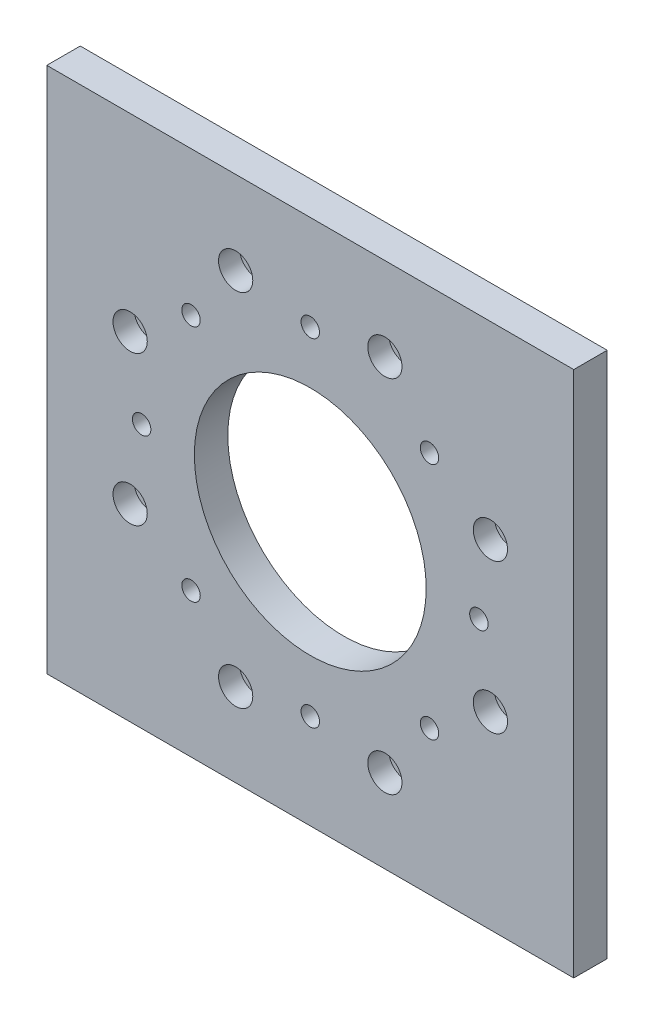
ISO-10303-21;
HEADER;
FILE_DESCRIPTION(('STEP AP214'),'2;1');
FILE_NAME('part.step','',(''),(''),'','','');
FILE_SCHEMA(('AUTOMOTIVE_DESIGN { 1 0 10303 214 1 1 1 1 }'));
ENDSEC;
DATA;
#1=APPLICATION_CONTEXT('core data for automotive mechanical design processes');
#2=APPLICATION_PROTOCOL_DEFINITION('international standard','automotive_design',2000,#1);
#3=PRODUCT_CONTEXT('',#1,'mechanical');
#4=PRODUCT('Part','Part','',(#3));
#5=PRODUCT_RELATED_PRODUCT_CATEGORY('part','',(#4));
#6=PRODUCT_DEFINITION_FORMATION('','',#4);
#7=PRODUCT_DEFINITION_CONTEXT('part definition',#1,'design');
#8=PRODUCT_DEFINITION('design','',#6,#7);
#9=PRODUCT_DEFINITION_SHAPE('','',#8);
#10=(LENGTH_UNIT() NAMED_UNIT(*) SI_UNIT(.MILLI.,.METRE.));
#11=(NAMED_UNIT(*) PLANE_ANGLE_UNIT() SI_UNIT($,.RADIAN.));
#12=(NAMED_UNIT(*) SI_UNIT($,.STERADIAN.) SOLID_ANGLE_UNIT());
#13=UNCERTAINTY_MEASURE_WITH_UNIT(LENGTH_MEASURE(1.E-05),#10,'distance_accuracy_value','');
#14=(GEOMETRIC_REPRESENTATION_CONTEXT(3) GLOBAL_UNCERTAINTY_ASSIGNED_CONTEXT((#13)) GLOBAL_UNIT_ASSIGNED_CONTEXT((#10,
#11,#12)) REPRESENTATION_CONTEXT('',''));
#15=CARTESIAN_POINT('',(0.,0.,0.));
#16=DIRECTION('',(0.,0.,1.));
#17=DIRECTION('',(1.,0.,0.));
#18=AXIS2_PLACEMENT_3D('',#15,#16,#17);
#19=CARTESIAN_POINT('',(34.1835427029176,14.1592869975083,0.));
#20=DIRECTION('',(0.,0.,1.));
#21=DIRECTION('',(1.,0.,0.));
#22=AXIS2_PLACEMENT_3D('',#19,#20,#21);
#23=CYLINDRICAL_SURFACE('',#22,1.5);
#24=CARTESIAN_POINT('',(34.1835427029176,14.1592869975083,0.));
#25=DIRECTION('',(0.,0.,1.));
#26=DIRECTION('',(1.,0.,0.));
#27=AXIS2_PLACEMENT_3D('',#24,#25,#26);
#28=CIRCLE('',#27,1.5);
#29=CARTESIAN_POINT('',(35.6835427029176,14.1592869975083,0.));
#30=VERTEX_POINT('',#29);
#31=EDGE_CURVE('E154',#30,#30,#28,.T.);
#32=ORIENTED_EDGE('',*,*,#31,.F.);
#33=EDGE_LOOP('',(#32));
#34=FACE_BOUND('',#33,.T.);
#35=CARTESIAN_POINT('',(34.1835427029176,14.1592869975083,2.35));
#36=DIRECTION('',(0.,0.,1.));
#37=DIRECTION('',(1.,0.,0.));
#38=AXIS2_PLACEMENT_3D('',#35,#36,#37);
#39=CIRCLE('',#38,1.5);
#40=CARTESIAN_POINT('',(35.6835427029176,14.1592869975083,2.35));
#41=VERTEX_POINT('',#40);
#42=EDGE_CURVE('E50',#41,#41,#39,.F.);
#43=ORIENTED_EDGE('',*,*,#42,.F.);
#44=EDGE_LOOP('',(#43));
#45=FACE_BOUND('',#44,.T.);
#46=ADVANCED_FACE('F43',(#34,#45),#23,.F.);
#47=CARTESIAN_POINT('',(34.1835427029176,-14.1592869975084,0.));
#48=DIRECTION('',(0.,0.,1.));
#49=DIRECTION('',(1.,0.,0.));
#50=AXIS2_PLACEMENT_3D('',#47,#48,#49);
#51=CYLINDRICAL_SURFACE('',#50,1.5);
#52=CARTESIAN_POINT('',(34.1835427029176,-14.1592869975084,0.));
#53=DIRECTION('',(0.,0.,1.));
#54=DIRECTION('',(1.,0.,0.));
#55=AXIS2_PLACEMENT_3D('',#52,#53,#54);
#56=CIRCLE('',#55,1.5);
#57=CARTESIAN_POINT('',(35.6835427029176,-14.1592869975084,0.));
#58=VERTEX_POINT('',#57);
#59=EDGE_CURVE('E157',#58,#58,#56,.T.);
#60=ORIENTED_EDGE('',*,*,#59,.F.);
#61=EDGE_LOOP('',(#60));
#62=FACE_BOUND('',#61,.T.);
#63=CARTESIAN_POINT('',(34.1835427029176,-14.1592869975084,2.35));
#64=DIRECTION('',(0.,0.,1.));
#65=DIRECTION('',(1.,0.,0.));
#66=AXIS2_PLACEMENT_3D('',#63,#64,#65);
#67=CIRCLE('',#66,1.5);
#68=CARTESIAN_POINT('',(35.6835427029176,-14.1592869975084,2.35));
#69=VERTEX_POINT('',#68);
#70=EDGE_CURVE('E140',#69,#69,#67,.F.);
#71=ORIENTED_EDGE('',*,*,#70,.F.);
#72=EDGE_LOOP('',(#71));
#73=FACE_BOUND('',#72,.T.);
#74=ADVANCED_FACE('F236',(#62,#73),#51,.F.);
#75=CARTESIAN_POINT('',(14.1592869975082,-34.1835427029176,0.));
#76=DIRECTION('',(0.,0.,1.));
#77=DIRECTION('',(1.,0.,0.));
#78=AXIS2_PLACEMENT_3D('',#75,#76,#77);
#79=CYLINDRICAL_SURFACE('',#78,1.5);
#80=CARTESIAN_POINT('',(14.1592869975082,-34.1835427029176,0.));
#81=DIRECTION('',(0.,0.,1.));
#82=DIRECTION('',(1.,0.,0.));
#83=AXIS2_PLACEMENT_3D('',#80,#81,#82);
#84=CIRCLE('',#83,1.5);
#85=CARTESIAN_POINT('',(15.6592869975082,-34.1835427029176,0.));
#86=VERTEX_POINT('',#85);
#87=EDGE_CURVE('E593',#86,#86,#84,.T.);
#88=ORIENTED_EDGE('',*,*,#87,.F.);
#89=EDGE_LOOP('',(#88));
#90=FACE_BOUND('',#89,.T.);
#91=CARTESIAN_POINT('',(14.1592869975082,-34.1835427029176,2.35));
#92=DIRECTION('',(0.,0.,1.));
#93=DIRECTION('',(1.,0.,0.));
#94=AXIS2_PLACEMENT_3D('',#91,#92,#93);
#95=CIRCLE('',#94,1.5);
#96=CARTESIAN_POINT('',(15.6592869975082,-34.1835427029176,2.35));
#97=VERTEX_POINT('',#96);
#98=EDGE_CURVE('E133',#97,#97,#95,.F.);
#99=ORIENTED_EDGE('',*,*,#98,.F.);
#100=EDGE_LOOP('',(#99));
#101=FACE_BOUND('',#100,.T.);
#102=ADVANCED_FACE('F241',(#90,#101),#79,.F.);
#103=CARTESIAN_POINT('',(-14.1592869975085,-34.1835427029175,0.));
#104=DIRECTION('',(0.,0.,1.));
#105=DIRECTION('',(1.,0.,0.));
#106=AXIS2_PLACEMENT_3D('',#103,#104,#105);
#107=CYLINDRICAL_SURFACE('',#106,1.5);
#108=CARTESIAN_POINT('',(-14.1592869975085,-34.1835427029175,0.));
#109=DIRECTION('',(0.,0.,1.));
#110=DIRECTION('',(1.,0.,0.));
#111=AXIS2_PLACEMENT_3D('',#108,#109,#110);
#112=CIRCLE('',#111,1.5);
#113=CARTESIAN_POINT('',(-12.6592869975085,-34.1835427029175,0.));
#114=VERTEX_POINT('',#113);
#115=EDGE_CURVE('E596',#114,#114,#112,.T.);
#116=ORIENTED_EDGE('',*,*,#115,.F.);
#117=EDGE_LOOP('',(#116));
#118=FACE_BOUND('',#117,.T.);
#119=CARTESIAN_POINT('',(-14.1592869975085,-34.1835427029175,2.35));
#120=DIRECTION('',(0.,0.,1.));
#121=DIRECTION('',(1.,0.,0.));
#122=AXIS2_PLACEMENT_3D('',#119,#120,#121);
#123=CIRCLE('',#122,1.5);
#124=CARTESIAN_POINT('',(-12.6592869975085,-34.1835427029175,2.35));
#125=VERTEX_POINT('',#124);
#126=EDGE_CURVE('E134',#125,#125,#123,.F.);
#127=ORIENTED_EDGE('',*,*,#126,.F.);
#128=EDGE_LOOP('',(#127));
#129=FACE_BOUND('',#128,.T.);
#130=ADVANCED_FACE('F384',(#118,#129),#107,.F.);
#131=CARTESIAN_POINT('',(-34.1835427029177,-14.1592869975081,0.));
#132=DIRECTION('',(0.,0.,1.));
#133=DIRECTION('',(1.,0.,0.));
#134=AXIS2_PLACEMENT_3D('',#131,#132,#133);
#135=CYLINDRICAL_SURFACE('',#134,1.50000000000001);
#136=CARTESIAN_POINT('',(-34.1835427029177,-14.1592869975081,0.));
#137=DIRECTION('',(0.,0.,1.));
#138=DIRECTION('',(1.,0.,0.));
#139=AXIS2_PLACEMENT_3D('',#136,#137,#138);
#140=CIRCLE('',#139,1.50000000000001);
#141=CARTESIAN_POINT('',(-32.6835427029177,-14.1592869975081,0.));
#142=VERTEX_POINT('',#141);
#143=EDGE_CURVE('E597',#142,#142,#140,.T.);
#144=ORIENTED_EDGE('',*,*,#143,.F.);
#145=EDGE_LOOP('',(#144));
#146=FACE_BOUND('',#145,.T.);
#147=CARTESIAN_POINT('',(-34.1835427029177,-14.1592869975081,2.35));
#148=DIRECTION('',(0.,0.,1.));
#149=DIRECTION('',(1.,0.,0.));
#150=AXIS2_PLACEMENT_3D('',#147,#148,#149);
#151=CIRCLE('',#150,1.50000000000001);
#152=CARTESIAN_POINT('',(-32.6835427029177,-14.1592869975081,2.35));
#153=VERTEX_POINT('',#152);
#154=EDGE_CURVE('E129',#153,#153,#151,.F.);
#155=ORIENTED_EDGE('',*,*,#154,.F.);
#156=EDGE_LOOP('',(#155));
#157=FACE_BOUND('',#156,.T.);
#158=ADVANCED_FACE('F374',(#146,#157),#135,.F.);
#159=CARTESIAN_POINT('',(-34.1835427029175,14.1592869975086,0.));
#160=DIRECTION('',(0.,0.,1.));
#161=DIRECTION('',(1.,0.,0.));
#162=AXIS2_PLACEMENT_3D('',#159,#160,#161);
#163=CYLINDRICAL_SURFACE('',#162,1.5);
#164=CARTESIAN_POINT('',(-34.1835427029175,14.1592869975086,0.));
#165=DIRECTION('',(0.,0.,1.));
#166=DIRECTION('',(1.,0.,0.));
#167=AXIS2_PLACEMENT_3D('',#164,#165,#166);
#168=CIRCLE('',#167,1.5);
#169=CARTESIAN_POINT('',(-32.6835427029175,14.1592869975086,0.));
#170=VERTEX_POINT('',#169);
#171=EDGE_CURVE('E151',#170,#170,#168,.T.);
#172=ORIENTED_EDGE('',*,*,#171,.F.);
#173=EDGE_LOOP('',(#172));
#174=FACE_BOUND('',#173,.T.);
#175=CARTESIAN_POINT('',(-34.1835427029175,14.1592869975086,2.35));
#176=DIRECTION('',(0.,0.,1.));
#177=DIRECTION('',(1.,0.,0.));
#178=AXIS2_PLACEMENT_3D('',#175,#176,#177);
#179=CIRCLE('',#178,1.5);
#180=CARTESIAN_POINT('',(-32.6835427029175,14.1592869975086,2.35));
#181=VERTEX_POINT('',#180);
#182=EDGE_CURVE('E127',#181,#181,#179,.F.);
#183=ORIENTED_EDGE('',*,*,#182,.F.);
#184=EDGE_LOOP('',(#183));
#185=FACE_BOUND('',#184,.T.);
#186=ADVANCED_FACE('F368',(#174,#185),#163,.F.);
#187=CARTESIAN_POINT('',(-14.159286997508,34.1835427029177,0.));
#188=DIRECTION('',(0.,0.,1.));
#189=DIRECTION('',(1.,0.,0.));
#190=AXIS2_PLACEMENT_3D('',#187,#188,#189);
#191=CYLINDRICAL_SURFACE('',#190,1.50000000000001);
#192=CARTESIAN_POINT('',(-14.159286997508,34.1835427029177,0.));
#193=DIRECTION('',(0.,0.,1.));
#194=DIRECTION('',(1.,0.,0.));
#195=AXIS2_PLACEMENT_3D('',#192,#193,#194);
#196=CIRCLE('',#195,1.50000000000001);
#197=CARTESIAN_POINT('',(-12.659286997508,34.1835427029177,0.));
#198=VERTEX_POINT('',#197);
#199=EDGE_CURVE('E148',#198,#198,#196,.T.);
#200=ORIENTED_EDGE('',*,*,#199,.F.);
#201=EDGE_LOOP('',(#200));
#202=FACE_BOUND('',#201,.T.);
#203=CARTESIAN_POINT('',(-14.159286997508,34.1835427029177,2.35));
#204=DIRECTION('',(0.,0.,1.));
#205=DIRECTION('',(1.,0.,0.));
#206=AXIS2_PLACEMENT_3D('',#203,#204,#205);
#207=CIRCLE('',#206,1.50000000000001);
#208=CARTESIAN_POINT('',(-12.659286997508,34.1835427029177,2.35));
#209=VERTEX_POINT('',#208);
#210=EDGE_CURVE('E125',#209,#209,#207,.F.);
#211=ORIENTED_EDGE('',*,*,#210,.F.);
#212=EDGE_LOOP('',(#211));
#213=FACE_BOUND('',#212,.T.);
#214=ADVANCED_FACE('F360',(#202,#213),#191,.F.);
#215=CARTESIAN_POINT('',(14.1592869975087,34.1835427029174,0.));
#216=DIRECTION('',(0.,0.,1.));
#217=DIRECTION('',(1.,0.,0.));
#218=AXIS2_PLACEMENT_3D('',#215,#216,#217);
#219=CYLINDRICAL_SURFACE('',#218,1.5);
#220=CARTESIAN_POINT('',(14.1592869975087,34.1835427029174,0.));
#221=DIRECTION('',(0.,0.,1.));
#222=DIRECTION('',(1.,0.,0.));
#223=AXIS2_PLACEMENT_3D('',#220,#221,#222);
#224=CIRCLE('',#223,1.5);
#225=CARTESIAN_POINT('',(15.6592869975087,34.1835427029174,0.));
#226=VERTEX_POINT('',#225);
#227=EDGE_CURVE('E142',#226,#226,#224,.T.);
#228=ORIENTED_EDGE('',*,*,#227,.F.);
#229=EDGE_LOOP('',(#228));
#230=FACE_BOUND('',#229,.T.);
#231=CARTESIAN_POINT('',(14.1592869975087,34.1835427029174,2.35));
#232=DIRECTION('',(0.,0.,1.));
#233=DIRECTION('',(1.,0.,0.));
#234=AXIS2_PLACEMENT_3D('',#231,#232,#233);
#235=CIRCLE('',#234,1.5);
#236=CARTESIAN_POINT('',(15.6592869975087,34.1835427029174,2.35));
#237=VERTEX_POINT('',#236);
#238=EDGE_CURVE('E116',#237,#237,#235,.F.);
#239=ORIENTED_EDGE('',*,*,#238,.F.);
#240=EDGE_LOOP('',(#239));
#241=FACE_BOUND('',#240,.T.);
#242=ADVANCED_FACE('F253',(#230,#241),#219,.F.);
#243=CARTESIAN_POINT('',(-49.9999999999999,50.,6.35));
#244=DIRECTION('',(0.,-1.,0.));
#245=DIRECTION('',(0.,0.,-1.));
#246=AXIS2_PLACEMENT_3D('',#243,#244,#245);
#247=PLANE('',#246);
#248=DIRECTION('',(-1.,0.,0.));
#249=VECTOR('',#248,1.);
#250=CARTESIAN_POINT('',(-49.9999999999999,50.,0.));
#251=LINE('',#250,#249);
#252=CARTESIAN_POINT('',(50.0000000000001,50.,0.));
#253=VERTEX_POINT('',#252);
#254=CARTESIAN_POINT('',(-49.9999999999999,50.,0.));
#255=VERTEX_POINT('',#254);
#256=EDGE_CURVE('E109',#253,#255,#251,.T.);
#257=ORIENTED_EDGE('',*,*,#256,.T.);
#258=DIRECTION('',(0.,0.,-1.));
#259=VECTOR('',#258,1.);
#260=CARTESIAN_POINT('',(-49.9999999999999,50.,6.35));
#261=LINE('',#260,#259);
#262=CARTESIAN_POINT('',(-49.9999999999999,50.,6.35));
#263=VERTEX_POINT('',#262);
#264=EDGE_CURVE('E11',#263,#255,#261,.T.);
#265=ORIENTED_EDGE('',*,*,#264,.F.);
#266=DIRECTION('',(-1.,0.,0.));
#267=VECTOR('',#266,1.);
#268=CARTESIAN_POINT('',(-49.9999999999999,50.,6.35));
#269=LINE('',#268,#267);
#270=CARTESIAN_POINT('',(50.0000000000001,50.,6.35));
#271=VERTEX_POINT('',#270);
#272=EDGE_CURVE('E100',#271,#263,#269,.T.);
#273=ORIENTED_EDGE('',*,*,#272,.F.);
#274=DIRECTION('',(0.,0.,-1.));
#275=VECTOR('',#274,1.);
#276=CARTESIAN_POINT('',(50.0000000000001,50.,6.35));
#277=LINE('',#276,#275);
#278=EDGE_CURVE('E106',#271,#253,#277,.T.);
#279=ORIENTED_EDGE('',*,*,#278,.T.);
#280=EDGE_LOOP('',(#257,#265,#273,#279));
#281=FACE_BOUND('',#280,.T.);
#282=ADVANCED_FACE('F44',(#281),#247,.F.);
#283=CARTESIAN_POINT('',(-49.9999999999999,-50.,6.35));
#284=DIRECTION('',(1.,0.,0.));
#285=DIRECTION('',(0.,0.,-1.));
#286=AXIS2_PLACEMENT_3D('',#283,#284,#285);
#287=PLANE('',#286);
#288=DIRECTION('',(0.,-1.,0.));
#289=VECTOR('',#288,1.);
#290=CARTESIAN_POINT('',(-49.9999999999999,-50.,0.));
#291=LINE('',#290,#289);
#292=CARTESIAN_POINT('',(-49.9999999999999,-50.,0.));
#293=VERTEX_POINT('',#292);
#294=EDGE_CURVE('E101',#255,#293,#291,.T.);
#295=ORIENTED_EDGE('',*,*,#294,.T.);
#296=DIRECTION('',(0.,0.,-1.));
#297=VECTOR('',#296,1.);
#298=CARTESIAN_POINT('',(-49.9999999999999,-50.,6.35));
#299=LINE('',#298,#297);
#300=CARTESIAN_POINT('',(-49.9999999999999,-50.,6.35));
#301=VERTEX_POINT('',#300);
#302=EDGE_CURVE('E52',#301,#293,#299,.T.);
#303=ORIENTED_EDGE('',*,*,#302,.F.);
#304=DIRECTION('',(0.,-1.,0.));
#305=VECTOR('',#304,1.);
#306=CARTESIAN_POINT('',(-49.9999999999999,-50.,6.35));
#307=LINE('',#306,#305);
#308=EDGE_CURVE('E95',#263,#301,#307,.T.);
#309=ORIENTED_EDGE('',*,*,#308,.F.);
#310=ORIENTED_EDGE('',*,*,#264,.T.);
#311=EDGE_LOOP('',(#295,#303,#309,#310));
#312=FACE_BOUND('',#311,.T.);
#313=ADVANCED_FACE('F99',(#312),#287,.F.);
#314=CARTESIAN_POINT('',(-49.9999999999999,-50.,6.35));
#315=DIRECTION('',(0.,1.,0.));
#316=DIRECTION('',(-1.,0.,0.));
#317=AXIS2_PLACEMENT_3D('',#314,#315,#316);
#318=PLANE('',#317);
#319=DIRECTION('',(1.,0.,0.));
#320=VECTOR('',#319,1.);
#321=CARTESIAN_POINT('',(-49.9999999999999,-50.,0.));
#322=LINE('',#321,#320);
#323=CARTESIAN_POINT('',(50.0000000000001,-49.9999999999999,0.));
#324=VERTEX_POINT('',#323);
#325=EDGE_CURVE('E76',#293,#324,#322,.T.);
#326=ORIENTED_EDGE('',*,*,#325,.T.);
#327=DIRECTION('',(0.,0.,-1.));
#328=VECTOR('',#327,1.);
#329=CARTESIAN_POINT('',(50.0000000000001,-49.9999999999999,6.35));
#330=LINE('',#329,#328);
#331=CARTESIAN_POINT('',(50.0000000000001,-49.9999999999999,6.35));
#332=VERTEX_POINT('',#331);
#333=EDGE_CURVE('E105',#332,#324,#330,.T.);
#334=ORIENTED_EDGE('',*,*,#333,.F.);
#335=DIRECTION('',(1.,0.,0.));
#336=VECTOR('',#335,1.);
#337=CARTESIAN_POINT('',(-49.9999999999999,-50.,6.35));
#338=LINE('',#337,#336);
#339=EDGE_CURVE('E92',#301,#332,#338,.T.);
#340=ORIENTED_EDGE('',*,*,#339,.F.);
#341=ORIENTED_EDGE('',*,*,#302,.T.);
#342=EDGE_LOOP('',(#326,#334,#340,#341));
#343=FACE_BOUND('',#342,.T.);
#344=ADVANCED_FACE('F102',(#343),#318,.F.);
#345=CARTESIAN_POINT('',(50.0000000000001,-49.9999999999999,6.35));
#346=DIRECTION('',(-1.,0.,0.));
#347=DIRECTION('',(0.,0.,1.));
#348=AXIS2_PLACEMENT_3D('',#345,#346,#347);
#349=PLANE('',#348);
#350=DIRECTION('',(0.,1.,0.));
#351=VECTOR('',#350,1.);
#352=CARTESIAN_POINT('',(50.0000000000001,-49.9999999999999,0.));
#353=LINE('',#352,#351);
#354=EDGE_CURVE('E84',#324,#253,#353,.T.);
#355=ORIENTED_EDGE('',*,*,#354,.T.);
#356=ORIENTED_EDGE('',*,*,#278,.F.);
#357=DIRECTION('',(0.,1.,0.));
#358=VECTOR('',#357,1.);
#359=CARTESIAN_POINT('',(50.0000000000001,-49.9999999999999,6.35));
#360=LINE('',#359,#358);
#361=EDGE_CURVE('E64',#332,#271,#360,.T.);
#362=ORIENTED_EDGE('',*,*,#361,.F.);
#363=ORIENTED_EDGE('',*,*,#333,.T.);
#364=EDGE_LOOP('',(#355,#356,#362,#363));
#365=FACE_BOUND('',#364,.T.);
#366=ADVANCED_FACE('F221',(#365),#349,.F.);
#367=CARTESIAN_POINT('',(0.,0.,6.35));
#368=DIRECTION('',(0.,0.,1.));
#369=DIRECTION('',(1.,0.,0.));
#370=AXIS2_PLACEMENT_3D('',#367,#368,#369);
#371=PLANE('',#370);
#372=CARTESIAN_POINT('',(14.1592869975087,34.1835427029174,6.35));
#373=DIRECTION('',(0.,0.,1.));
#374=DIRECTION('',(1.,0.,0.));
#375=AXIS2_PLACEMENT_3D('',#372,#373,#374);
#376=CIRCLE('',#375,3.25000000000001);
#377=CARTESIAN_POINT('',(17.4092869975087,34.1835427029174,6.35));
#378=VERTEX_POINT('',#377);
#379=EDGE_CURVE('E661',#378,#378,#376,.T.);
#380=ORIENTED_EDGE('',*,*,#379,.F.);
#381=EDGE_LOOP('',(#380));
#382=FACE_BOUND('',#381,.T.);
#383=CARTESIAN_POINT('',(-14.159286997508,34.1835427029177,6.35));
#384=DIRECTION('',(0.,0.,1.));
#385=DIRECTION('',(1.,0.,0.));
#386=AXIS2_PLACEMENT_3D('',#383,#384,#385);
#387=CIRCLE('',#386,3.25);
#388=CARTESIAN_POINT('',(-10.909286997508,34.1835427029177,6.35));
#389=VERTEX_POINT('',#388);
#390=EDGE_CURVE('E668',#389,#389,#387,.T.);
#391=ORIENTED_EDGE('',*,*,#390,.F.);
#392=EDGE_LOOP('',(#391));
#393=FACE_BOUND('',#392,.T.);
#394=CARTESIAN_POINT('',(-34.1835427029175,14.1592869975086,6.35));
#395=DIRECTION('',(0.,0.,1.));
#396=DIRECTION('',(1.,0.,0.));
#397=AXIS2_PLACEMENT_3D('',#394,#395,#396);
#398=CIRCLE('',#397,3.25);
#399=CARTESIAN_POINT('',(-30.9335427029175,14.1592869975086,6.35));
#400=VERTEX_POINT('',#399);
#401=EDGE_CURVE('E677',#400,#400,#398,.T.);
#402=ORIENTED_EDGE('',*,*,#401,.F.);
#403=EDGE_LOOP('',(#402));
#404=FACE_BOUND('',#403,.T.);
#405=CARTESIAN_POINT('',(-34.1835427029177,-14.1592869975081,6.35));
#406=DIRECTION('',(0.,0.,1.));
#407=DIRECTION('',(1.,0.,0.));
#408=AXIS2_PLACEMENT_3D('',#405,#406,#407);
#409=CIRCLE('',#408,3.25);
#410=CARTESIAN_POINT('',(-30.9335427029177,-14.1592869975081,6.35));
#411=VERTEX_POINT('',#410);
#412=EDGE_CURVE('E684',#411,#411,#409,.T.);
#413=ORIENTED_EDGE('',*,*,#412,.F.);
#414=EDGE_LOOP('',(#413));
#415=FACE_BOUND('',#414,.T.);
#416=CARTESIAN_POINT('',(-14.1592869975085,-34.1835427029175,6.35));
#417=DIRECTION('',(0.,0.,1.));
#418=DIRECTION('',(1.,0.,0.));
#419=AXIS2_PLACEMENT_3D('',#416,#417,#418);
#420=CIRCLE('',#419,3.25);
#421=CARTESIAN_POINT('',(-10.9092869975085,-34.1835427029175,6.35));
#422=VERTEX_POINT('',#421);
#423=EDGE_CURVE('E687',#422,#422,#420,.T.);
#424=ORIENTED_EDGE('',*,*,#423,.F.);
#425=EDGE_LOOP('',(#424));
#426=FACE_BOUND('',#425,.T.);
#427=CARTESIAN_POINT('',(14.1592869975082,-34.1835427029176,6.35));
#428=DIRECTION('',(0.,0.,1.));
#429=DIRECTION('',(1.,0.,0.));
#430=AXIS2_PLACEMENT_3D('',#427,#428,#429);
#431=CIRCLE('',#430,3.25);
#432=CARTESIAN_POINT('',(17.4092869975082,-34.1835427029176,6.35));
#433=VERTEX_POINT('',#432);
#434=EDGE_CURVE('E695',#433,#433,#431,.T.);
#435=ORIENTED_EDGE('',*,*,#434,.F.);
#436=EDGE_LOOP('',(#435));
#437=FACE_BOUND('',#436,.T.);
#438=CARTESIAN_POINT('',(34.1835427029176,-14.1592869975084,6.35));
#439=DIRECTION('',(0.,0.,1.));
#440=DIRECTION('',(1.,0.,0.));
#441=AXIS2_PLACEMENT_3D('',#438,#439,#440);
#442=CIRCLE('',#441,3.25);
#443=CARTESIAN_POINT('',(37.4335427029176,-14.1592869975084,6.35));
#444=VERTEX_POINT('',#443);
#445=EDGE_CURVE('E581',#444,#444,#442,.T.);
#446=ORIENTED_EDGE('',*,*,#445,.F.);
#447=EDGE_LOOP('',(#446));
#448=FACE_BOUND('',#447,.T.);
#449=CARTESIAN_POINT('',(34.1835427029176,14.1592869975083,6.35));
#450=DIRECTION('',(0.,0.,1.));
#451=DIRECTION('',(1.,0.,0.));
#452=AXIS2_PLACEMENT_3D('',#449,#450,#451);
#453=CIRCLE('',#452,3.25);
#454=CARTESIAN_POINT('',(37.4335427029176,14.1592869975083,6.35));
#455=VERTEX_POINT('',#454);
#456=EDGE_CURVE('E583',#455,#455,#453,.T.);
#457=ORIENTED_EDGE('',*,*,#456,.F.);
#458=EDGE_LOOP('',(#457));
#459=FACE_BOUND('',#458,.T.);
#460=CARTESIAN_POINT('',(0.,0.,6.35));
#461=DIRECTION('',(0.,0.,1.));
#462=DIRECTION('',(1.,0.,0.));
#463=AXIS2_PLACEMENT_3D('',#460,#461,#462);
#464=CIRCLE('',#463,22.);
#465=CARTESIAN_POINT('',(22.,0.,6.35));
#466=VERTEX_POINT('',#465);
#467=EDGE_CURVE('E158',#466,#466,#464,.T.);
#468=ORIENTED_EDGE('',*,*,#467,.F.);
#469=EDGE_LOOP('',(#468));
#470=FACE_BOUND('',#469,.T.);
#471=CARTESIAN_POINT('',(32.,0.,6.35));
#472=DIRECTION('',(0.,0.,1.));
#473=DIRECTION('',(1.,0.,0.));
#474=AXIS2_PLACEMENT_3D('',#471,#472,#473);
#475=CIRCLE('',#474,1.75);
#476=CARTESIAN_POINT('',(33.75,0.,6.35));
#477=VERTEX_POINT('',#476);
#478=EDGE_CURVE('E169',#477,#477,#475,.T.);
#479=ORIENTED_EDGE('',*,*,#478,.F.);
#480=EDGE_LOOP('',(#479));
#481=FACE_BOUND('',#480,.T.);
#482=CARTESIAN_POINT('',(22.6274169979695,-22.6274169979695,6.35));
#483=DIRECTION('',(0.,0.,1.));
#484=DIRECTION('',(1.,0.,0.));
#485=AXIS2_PLACEMENT_3D('',#482,#483,#484);
#486=CIRCLE('',#485,1.75);
#487=CARTESIAN_POINT('',(24.3774169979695,-22.6274169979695,6.35));
#488=VERTEX_POINT('',#487);
#489=EDGE_CURVE('E172',#488,#488,#486,.T.);
#490=ORIENTED_EDGE('',*,*,#489,.F.);
#491=EDGE_LOOP('',(#490));
#492=FACE_BOUND('',#491,.T.);
#493=CARTESIAN_POINT('',(0.,-32.,6.35));
#494=DIRECTION('',(0.,0.,1.));
#495=DIRECTION('',(1.,0.,0.));
#496=AXIS2_PLACEMENT_3D('',#493,#494,#495);
#497=CIRCLE('',#496,1.75);
#498=CARTESIAN_POINT('',(1.75,-32.,6.35));
#499=VERTEX_POINT('',#498);
#500=EDGE_CURVE('E180',#499,#499,#497,.T.);
#501=ORIENTED_EDGE('',*,*,#500,.F.);
#502=EDGE_LOOP('',(#501));
#503=FACE_BOUND('',#502,.T.);
#504=CARTESIAN_POINT('',(-22.6274169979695,-22.6274169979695,6.35));
#505=DIRECTION('',(0.,0.,1.));
#506=DIRECTION('',(1.,0.,0.));
#507=AXIS2_PLACEMENT_3D('',#504,#505,#506);
#508=CIRCLE('',#507,1.75);
#509=CARTESIAN_POINT('',(-20.8774169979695,-22.6274169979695,6.35));
#510=VERTEX_POINT('',#509);
#511=EDGE_CURVE('E181',#510,#510,#508,.T.);
#512=ORIENTED_EDGE('',*,*,#511,.F.);
#513=EDGE_LOOP('',(#512));
#514=FACE_BOUND('',#513,.T.);
#515=CARTESIAN_POINT('',(-32.,0.,6.35));
#516=DIRECTION('',(0.,0.,1.));
#517=DIRECTION('',(1.,0.,0.));
#518=AXIS2_PLACEMENT_3D('',#515,#516,#517);
#519=CIRCLE('',#518,1.75);
#520=CARTESIAN_POINT('',(-30.25,0.,6.35));
#521=VERTEX_POINT('',#520);
#522=EDGE_CURVE('E186',#521,#521,#519,.T.);
#523=ORIENTED_EDGE('',*,*,#522,.F.);
#524=EDGE_LOOP('',(#523));
#525=FACE_BOUND('',#524,.T.);
#526=CARTESIAN_POINT('',(-22.6274169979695,22.6274169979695,6.35));
#527=DIRECTION('',(0.,0.,1.));
#528=DIRECTION('',(1.,0.,0.));
#529=AXIS2_PLACEMENT_3D('',#526,#527,#528);
#530=CIRCLE('',#529,1.75);
#531=CARTESIAN_POINT('',(-20.8774169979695,22.6274169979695,6.35));
#532=VERTEX_POINT('',#531);
#533=EDGE_CURVE('E194',#532,#532,#530,.T.);
#534=ORIENTED_EDGE('',*,*,#533,.F.);
#535=EDGE_LOOP('',(#534));
#536=FACE_BOUND('',#535,.T.);
#537=CARTESIAN_POINT('',(0.,32.,6.35));
#538=DIRECTION('',(0.,0.,1.));
#539=DIRECTION('',(1.,0.,0.));
#540=AXIS2_PLACEMENT_3D('',#537,#538,#539);
#541=CIRCLE('',#540,1.75);
#542=CARTESIAN_POINT('',(1.74999999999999,32.,6.35));
#543=VERTEX_POINT('',#542);
#544=EDGE_CURVE('E203',#543,#543,#541,.T.);
#545=ORIENTED_EDGE('',*,*,#544,.F.);
#546=EDGE_LOOP('',(#545));
#547=FACE_BOUND('',#546,.T.);
#548=CARTESIAN_POINT('',(22.6274169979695,22.6274169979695,6.35));
#549=DIRECTION('',(0.,0.,1.));
#550=DIRECTION('',(1.,0.,0.));
#551=AXIS2_PLACEMENT_3D('',#548,#549,#550);
#552=CIRCLE('',#551,1.75);
#553=CARTESIAN_POINT('',(24.3774169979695,22.6274169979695,6.35));
#554=VERTEX_POINT('',#553);
#555=EDGE_CURVE('E210',#554,#554,#552,.T.);
#556=ORIENTED_EDGE('',*,*,#555,.F.);
#557=EDGE_LOOP('',(#556));
#558=FACE_BOUND('',#557,.T.);
#559=ORIENTED_EDGE('',*,*,#272,.T.);
#560=ORIENTED_EDGE('',*,*,#308,.T.);
#561=ORIENTED_EDGE('',*,*,#339,.T.);
#562=ORIENTED_EDGE('',*,*,#361,.T.);
#563=EDGE_LOOP('',(#559,#560,#561,#562));
#564=FACE_BOUND('',#563,.T.);
#565=ADVANCED_FACE('F91',(#382,#393,#404,#415,#426,#437,#448,#459,#470,#481,#492,#503,#514,#525,
#536,#547,#558,#564),#371,.T.);
#566=CARTESIAN_POINT('',(0.,0.,0.));
#567=DIRECTION('',(0.,0.,1.));
#568=DIRECTION('',(1.,0.,0.));
#569=AXIS2_PLACEMENT_3D('',#566,#567,#568);
#570=PLANE('',#569);
#571=ORIENTED_EDGE('',*,*,#227,.T.);
#572=EDGE_LOOP('',(#571));
#573=FACE_BOUND('',#572,.T.);
#574=ORIENTED_EDGE('',*,*,#199,.T.);
#575=EDGE_LOOP('',(#574));
#576=FACE_BOUND('',#575,.T.);
#577=ORIENTED_EDGE('',*,*,#171,.T.);
#578=EDGE_LOOP('',(#577));
#579=FACE_BOUND('',#578,.T.);
#580=ORIENTED_EDGE('',*,*,#143,.T.);
#581=EDGE_LOOP('',(#580));
#582=FACE_BOUND('',#581,.T.);
#583=ORIENTED_EDGE('',*,*,#115,.T.);
#584=EDGE_LOOP('',(#583));
#585=FACE_BOUND('',#584,.T.);
#586=ORIENTED_EDGE('',*,*,#87,.T.);
#587=EDGE_LOOP('',(#586));
#588=FACE_BOUND('',#587,.T.);
#589=ORIENTED_EDGE('',*,*,#59,.T.);
#590=EDGE_LOOP('',(#589));
#591=FACE_BOUND('',#590,.T.);
#592=ORIENTED_EDGE('',*,*,#31,.T.);
#593=EDGE_LOOP('',(#592));
#594=FACE_BOUND('',#593,.T.);
#595=CARTESIAN_POINT('',(0.,0.,0.));
#596=DIRECTION('',(0.,0.,1.));
#597=DIRECTION('',(1.,0.,0.));
#598=AXIS2_PLACEMENT_3D('',#595,#596,#597);
#599=CIRCLE('',#598,22.);
#600=CARTESIAN_POINT('',(22.,0.,0.));
#601=VERTEX_POINT('',#600);
#602=EDGE_CURVE('E159',#601,#601,#599,.T.);
#603=ORIENTED_EDGE('',*,*,#602,.T.);
#604=EDGE_LOOP('',(#603));
#605=FACE_BOUND('',#604,.T.);
#606=CARTESIAN_POINT('',(32.,0.,0.));
#607=DIRECTION('',(0.,0.,1.));
#608=DIRECTION('',(1.,0.,0.));
#609=AXIS2_PLACEMENT_3D('',#606,#607,#608);
#610=CIRCLE('',#609,1.75);
#611=CARTESIAN_POINT('',(33.75,0.,0.));
#612=VERTEX_POINT('',#611);
#613=EDGE_CURVE('E114',#612,#612,#610,.T.);
#614=ORIENTED_EDGE('',*,*,#613,.T.);
#615=EDGE_LOOP('',(#614));
#616=FACE_BOUND('',#615,.T.);
#617=CARTESIAN_POINT('',(22.6274169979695,-22.6274169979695,0.));
#618=DIRECTION('',(0.,0.,1.));
#619=DIRECTION('',(1.,0.,0.));
#620=AXIS2_PLACEMENT_3D('',#617,#618,#619);
#621=CIRCLE('',#620,1.75);
#622=CARTESIAN_POINT('',(24.3774169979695,-22.6274169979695,0.));
#623=VERTEX_POINT('',#622);
#624=EDGE_CURVE('E171',#623,#623,#621,.T.);
#625=ORIENTED_EDGE('',*,*,#624,.T.);
#626=EDGE_LOOP('',(#625));
#627=FACE_BOUND('',#626,.T.);
#628=CARTESIAN_POINT('',(0.,-32.,0.));
#629=DIRECTION('',(0.,0.,1.));
#630=DIRECTION('',(1.,0.,0.));
#631=AXIS2_PLACEMENT_3D('',#628,#629,#630);
#632=CIRCLE('',#631,1.75);
#633=CARTESIAN_POINT('',(1.75,-32.,0.));
#634=VERTEX_POINT('',#633);
#635=EDGE_CURVE('E179',#634,#634,#632,.T.);
#636=ORIENTED_EDGE('',*,*,#635,.T.);
#637=EDGE_LOOP('',(#636));
#638=FACE_BOUND('',#637,.T.);
#639=CARTESIAN_POINT('',(-22.6274169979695,-22.6274169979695,0.));
#640=DIRECTION('',(0.,0.,1.));
#641=DIRECTION('',(1.,0.,0.));
#642=AXIS2_PLACEMENT_3D('',#639,#640,#641);
#643=CIRCLE('',#642,1.75);
#644=CARTESIAN_POINT('',(-20.8774169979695,-22.6274169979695,0.));
#645=VERTEX_POINT('',#644);
#646=EDGE_CURVE('E187',#645,#645,#643,.T.);
#647=ORIENTED_EDGE('',*,*,#646,.T.);
#648=EDGE_LOOP('',(#647));
#649=FACE_BOUND('',#648,.T.);
#650=CARTESIAN_POINT('',(-32.,0.,0.));
#651=DIRECTION('',(0.,0.,1.));
#652=DIRECTION('',(1.,0.,0.));
#653=AXIS2_PLACEMENT_3D('',#650,#651,#652);
#654=CIRCLE('',#653,1.75);
#655=CARTESIAN_POINT('',(-30.25,0.,0.));
#656=VERTEX_POINT('',#655);
#657=EDGE_CURVE('E195',#656,#656,#654,.T.);
#658=ORIENTED_EDGE('',*,*,#657,.T.);
#659=EDGE_LOOP('',(#658));
#660=FACE_BOUND('',#659,.T.);
#661=CARTESIAN_POINT('',(-22.6274169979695,22.6274169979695,0.));
#662=DIRECTION('',(0.,0.,1.));
#663=DIRECTION('',(1.,0.,0.));
#664=AXIS2_PLACEMENT_3D('',#661,#662,#663);
#665=CIRCLE('',#664,1.75);
#666=CARTESIAN_POINT('',(-20.8774169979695,22.6274169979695,0.));
#667=VERTEX_POINT('',#666);
#668=EDGE_CURVE('E196',#667,#667,#665,.T.);
#669=ORIENTED_EDGE('',*,*,#668,.T.);
#670=EDGE_LOOP('',(#669));
#671=FACE_BOUND('',#670,.T.);
#672=CARTESIAN_POINT('',(0.,32.,0.));
#673=DIRECTION('',(0.,0.,1.));
#674=DIRECTION('',(1.,0.,0.));
#675=AXIS2_PLACEMENT_3D('',#672,#673,#674);
#676=CIRCLE('',#675,1.75);
#677=CARTESIAN_POINT('',(1.74999999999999,32.,0.));
#678=VERTEX_POINT('',#677);
#679=EDGE_CURVE('E204',#678,#678,#676,.T.);
#680=ORIENTED_EDGE('',*,*,#679,.T.);
#681=EDGE_LOOP('',(#680));
#682=FACE_BOUND('',#681,.T.);
#683=CARTESIAN_POINT('',(22.6274169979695,22.6274169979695,0.));
#684=DIRECTION('',(0.,0.,1.));
#685=DIRECTION('',(1.,0.,0.));
#686=AXIS2_PLACEMENT_3D('',#683,#684,#685);
#687=CIRCLE('',#686,1.75);
#688=CARTESIAN_POINT('',(24.3774169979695,22.6274169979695,0.));
#689=VERTEX_POINT('',#688);
#690=EDGE_CURVE('E162',#689,#689,#687,.T.);
#691=ORIENTED_EDGE('',*,*,#690,.T.);
#692=EDGE_LOOP('',(#691));
#693=FACE_BOUND('',#692,.T.);
#694=ORIENTED_EDGE('',*,*,#256,.F.);
#695=ORIENTED_EDGE('',*,*,#354,.F.);
#696=ORIENTED_EDGE('',*,*,#325,.F.);
#697=ORIENTED_EDGE('',*,*,#294,.F.);
#698=EDGE_LOOP('',(#694,#695,#696,#697));
#699=FACE_BOUND('',#698,.T.);
#700=ADVANCED_FACE('F213',(#573,#576,#579,#582,#585,#588,#591,#594,#605,#616,#627,#638,#649,
#660,#671,#682,#693,#699),#570,.F.);
#701=CARTESIAN_POINT('',(22.6274169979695,22.6274169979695,0.));
#702=DIRECTION('',(0.,0.,1.));
#703=DIRECTION('',(1.,0.,0.));
#704=AXIS2_PLACEMENT_3D('',#701,#702,#703);
#705=CYLINDRICAL_SURFACE('',#704,1.75);
#706=ORIENTED_EDGE('',*,*,#690,.F.);
#707=EDGE_LOOP('',(#706));
#708=FACE_BOUND('',#707,.T.);
#709=ORIENTED_EDGE('',*,*,#555,.T.);
#710=EDGE_LOOP('',(#709));
#711=FACE_BOUND('',#710,.T.);
#712=ADVANCED_FACE('F216',(#708,#711),#705,.F.);
#713=CARTESIAN_POINT('',(0.,32.,0.));
#714=DIRECTION('',(0.,0.,1.));
#715=DIRECTION('',(1.,0.,0.));
#716=AXIS2_PLACEMENT_3D('',#713,#714,#715);
#717=CYLINDRICAL_SURFACE('',#716,1.75);
#718=ORIENTED_EDGE('',*,*,#679,.F.);
#719=EDGE_LOOP('',(#718));
#720=FACE_BOUND('',#719,.T.);
#721=ORIENTED_EDGE('',*,*,#544,.T.);
#722=EDGE_LOOP('',(#721));
#723=FACE_BOUND('',#722,.T.);
#724=ADVANCED_FACE('F218',(#720,#723),#717,.F.);
#725=CARTESIAN_POINT('',(-22.6274169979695,22.6274169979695,0.));
#726=DIRECTION('',(0.,0.,1.));
#727=DIRECTION('',(1.,0.,0.));
#728=AXIS2_PLACEMENT_3D('',#725,#726,#727);
#729=CYLINDRICAL_SURFACE('',#728,1.75);
#730=ORIENTED_EDGE('',*,*,#668,.F.);
#731=EDGE_LOOP('',(#730));
#732=FACE_BOUND('',#731,.T.);
#733=ORIENTED_EDGE('',*,*,#533,.T.);
#734=EDGE_LOOP('',(#733));
#735=FACE_BOUND('',#734,.T.);
#736=ADVANCED_FACE('F280',(#732,#735),#729,.F.);
#737=CARTESIAN_POINT('',(-32.,0.,0.));
#738=DIRECTION('',(0.,0.,1.));
#739=DIRECTION('',(1.,0.,0.));
#740=AXIS2_PLACEMENT_3D('',#737,#738,#739);
#741=CYLINDRICAL_SURFACE('',#740,1.75);
#742=ORIENTED_EDGE('',*,*,#657,.F.);
#743=EDGE_LOOP('',(#742));
#744=FACE_BOUND('',#743,.T.);
#745=ORIENTED_EDGE('',*,*,#522,.T.);
#746=EDGE_LOOP('',(#745));
#747=FACE_BOUND('',#746,.T.);
#748=ADVANCED_FACE('F272',(#744,#747),#741,.F.);
#749=CARTESIAN_POINT('',(-22.6274169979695,-22.6274169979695,0.));
#750=DIRECTION('',(0.,0.,1.));
#751=DIRECTION('',(1.,0.,0.));
#752=AXIS2_PLACEMENT_3D('',#749,#750,#751);
#753=CYLINDRICAL_SURFACE('',#752,1.75);
#754=ORIENTED_EDGE('',*,*,#646,.F.);
#755=EDGE_LOOP('',(#754));
#756=FACE_BOUND('',#755,.T.);
#757=ORIENTED_EDGE('',*,*,#511,.T.);
#758=EDGE_LOOP('',(#757));
#759=FACE_BOUND('',#758,.T.);
#760=ADVANCED_FACE('F267',(#756,#759),#753,.F.);
#761=CARTESIAN_POINT('',(0.,-32.,0.));
#762=DIRECTION('',(0.,0.,1.));
#763=DIRECTION('',(1.,0.,0.));
#764=AXIS2_PLACEMENT_3D('',#761,#762,#763);
#765=CYLINDRICAL_SURFACE('',#764,1.75);
#766=ORIENTED_EDGE('',*,*,#635,.F.);
#767=EDGE_LOOP('',(#766));
#768=FACE_BOUND('',#767,.T.);
#769=ORIENTED_EDGE('',*,*,#500,.T.);
#770=EDGE_LOOP('',(#769));
#771=FACE_BOUND('',#770,.T.);
#772=ADVANCED_FACE('F264',(#768,#771),#765,.F.);
#773=CARTESIAN_POINT('',(22.6274169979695,-22.6274169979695,0.));
#774=DIRECTION('',(0.,0.,1.));
#775=DIRECTION('',(1.,0.,0.));
#776=AXIS2_PLACEMENT_3D('',#773,#774,#775);
#777=CYLINDRICAL_SURFACE('',#776,1.75);
#778=ORIENTED_EDGE('',*,*,#624,.F.);
#779=EDGE_LOOP('',(#778));
#780=FACE_BOUND('',#779,.T.);
#781=ORIENTED_EDGE('',*,*,#489,.T.);
#782=EDGE_LOOP('',(#781));
#783=FACE_BOUND('',#782,.T.);
#784=ADVANCED_FACE('F261',(#780,#783),#777,.F.);
#785=CARTESIAN_POINT('',(32.,0.,0.));
#786=DIRECTION('',(0.,0.,1.));
#787=DIRECTION('',(1.,0.,0.));
#788=AXIS2_PLACEMENT_3D('',#785,#786,#787);
#789=CYLINDRICAL_SURFACE('',#788,1.75);
#790=ORIENTED_EDGE('',*,*,#613,.F.);
#791=EDGE_LOOP('',(#790));
#792=FACE_BOUND('',#791,.T.);
#793=ORIENTED_EDGE('',*,*,#478,.T.);
#794=EDGE_LOOP('',(#793));
#795=FACE_BOUND('',#794,.T.);
#796=ADVANCED_FACE('F260',(#792,#795),#789,.F.);
#797=CARTESIAN_POINT('',(0.,0.,0.));
#798=DIRECTION('',(0.,0.,1.));
#799=DIRECTION('',(1.,0.,0.));
#800=AXIS2_PLACEMENT_3D('',#797,#798,#799);
#801=CYLINDRICAL_SURFACE('',#800,22.);
#802=ORIENTED_EDGE('',*,*,#602,.F.);
#803=EDGE_LOOP('',(#802));
#804=FACE_BOUND('',#803,.T.);
#805=ORIENTED_EDGE('',*,*,#467,.T.);
#806=EDGE_LOOP('',(#805));
#807=FACE_BOUND('',#806,.T.);
#808=ADVANCED_FACE('F251',(#804,#807),#801,.F.);
#809=CARTESIAN_POINT('',(14.1592869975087,34.1835427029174,2.35));
#810=DIRECTION('',(0.,0.,1.));
#811=DIRECTION('',(1.,0.,0.));
#812=AXIS2_PLACEMENT_3D('',#809,#810,#811);
#813=PLANE('',#812);
#814=CARTESIAN_POINT('',(14.1592869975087,34.1835427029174,2.35));
#815=DIRECTION('',(0.,0.,1.));
#816=DIRECTION('',(1.,0.,0.));
#817=AXIS2_PLACEMENT_3D('',#814,#815,#816);
#818=CIRCLE('',#817,3.25000000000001);
#819=CARTESIAN_POINT('',(17.4092869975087,34.1835427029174,2.35));
#820=VERTEX_POINT('',#819);
#821=EDGE_CURVE('E662',#820,#820,#818,.T.);
#822=ORIENTED_EDGE('',*,*,#821,.T.);
#823=EDGE_LOOP('',(#822));
#824=FACE_BOUND('',#823,.T.);
#825=ORIENTED_EDGE('',*,*,#238,.T.);
#826=EDGE_LOOP('',(#825));
#827=FACE_BOUND('',#826,.T.);
#828=ADVANCED_FACE('F258',(#824,#827),#813,.T.);
#829=CARTESIAN_POINT('',(14.1592869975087,34.1835427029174,2.35));
#830=DIRECTION('',(0.,0.,1.));
#831=DIRECTION('',(1.,0.,0.));
#832=AXIS2_PLACEMENT_3D('',#829,#830,#831);
#833=CYLINDRICAL_SURFACE('',#832,3.25000000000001);
#834=ORIENTED_EDGE('',*,*,#821,.F.);
#835=EDGE_LOOP('',(#834));
#836=FACE_BOUND('',#835,.T.);
#837=ORIENTED_EDGE('',*,*,#379,.T.);
#838=EDGE_LOOP('',(#837));
#839=FACE_BOUND('',#838,.T.);
#840=ADVANCED_FACE('F425',(#836,#839),#833,.F.);
#841=CARTESIAN_POINT('',(-14.159286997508,34.1835427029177,2.35));
#842=DIRECTION('',(0.,0.,1.));
#843=DIRECTION('',(1.,0.,0.));
#844=AXIS2_PLACEMENT_3D('',#841,#842,#843);
#845=PLANE('',#844);
#846=CARTESIAN_POINT('',(-14.159286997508,34.1835427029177,2.35));
#847=DIRECTION('',(0.,0.,1.));
#848=DIRECTION('',(1.,0.,0.));
#849=AXIS2_PLACEMENT_3D('',#846,#847,#848);
#850=CIRCLE('',#849,3.25);
#851=CARTESIAN_POINT('',(-10.909286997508,34.1835427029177,2.35));
#852=VERTEX_POINT('',#851);
#853=EDGE_CURVE('E669',#852,#852,#850,.T.);
#854=ORIENTED_EDGE('',*,*,#853,.T.);
#855=EDGE_LOOP('',(#854));
#856=FACE_BOUND('',#855,.T.);
#857=ORIENTED_EDGE('',*,*,#210,.T.);
#858=EDGE_LOOP('',(#857));
#859=FACE_BOUND('',#858,.T.);
#860=ADVANCED_FACE('F431',(#856,#859),#845,.T.);
#861=CARTESIAN_POINT('',(-14.159286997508,34.1835427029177,2.35));
#862=DIRECTION('',(0.,0.,1.));
#863=DIRECTION('',(1.,0.,0.));
#864=AXIS2_PLACEMENT_3D('',#861,#862,#863);
#865=CYLINDRICAL_SURFACE('',#864,3.25);
#866=ORIENTED_EDGE('',*,*,#853,.F.);
#867=EDGE_LOOP('',(#866));
#868=FACE_BOUND('',#867,.T.);
#869=ORIENTED_EDGE('',*,*,#390,.T.);
#870=EDGE_LOOP('',(#869));
#871=FACE_BOUND('',#870,.T.);
#872=ADVANCED_FACE('F439',(#868,#871),#865,.F.);
#873=CARTESIAN_POINT('',(-34.1835427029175,14.1592869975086,2.35));
#874=DIRECTION('',(0.,0.,1.));
#875=DIRECTION('',(1.,0.,0.));
#876=AXIS2_PLACEMENT_3D('',#873,#874,#875);
#877=PLANE('',#876);
#878=CARTESIAN_POINT('',(-34.1835427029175,14.1592869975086,2.35));
#879=DIRECTION('',(0.,0.,1.));
#880=DIRECTION('',(1.,0.,0.));
#881=AXIS2_PLACEMENT_3D('',#878,#879,#880);
#882=CIRCLE('',#881,3.25);
#883=CARTESIAN_POINT('',(-30.9335427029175,14.1592869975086,2.35));
#884=VERTEX_POINT('',#883);
#885=EDGE_CURVE('E672',#884,#884,#882,.T.);
#886=ORIENTED_EDGE('',*,*,#885,.T.);
#887=EDGE_LOOP('',(#886));
#888=FACE_BOUND('',#887,.T.);
#889=ORIENTED_EDGE('',*,*,#182,.T.);
#890=EDGE_LOOP('',(#889));
#891=FACE_BOUND('',#890,.T.);
#892=ADVANCED_FACE('F446',(#888,#891),#877,.T.);
#893=CARTESIAN_POINT('',(-34.1835427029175,14.1592869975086,2.35));
#894=DIRECTION('',(0.,0.,1.));
#895=DIRECTION('',(1.,0.,0.));
#896=AXIS2_PLACEMENT_3D('',#893,#894,#895);
#897=CYLINDRICAL_SURFACE('',#896,3.25);
#898=ORIENTED_EDGE('',*,*,#885,.F.);
#899=EDGE_LOOP('',(#898));
#900=FACE_BOUND('',#899,.T.);
#901=ORIENTED_EDGE('',*,*,#401,.T.);
#902=EDGE_LOOP('',(#901));
#903=FACE_BOUND('',#902,.T.);
#904=ADVANCED_FACE('F456',(#900,#903),#897,.F.);
#905=CARTESIAN_POINT('',(-34.1835427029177,-14.1592869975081,2.35));
#906=DIRECTION('',(0.,0.,1.));
#907=DIRECTION('',(1.,0.,0.));
#908=AXIS2_PLACEMENT_3D('',#905,#906,#907);
#909=PLANE('',#908);
#910=CARTESIAN_POINT('',(-34.1835427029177,-14.1592869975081,2.35));
#911=DIRECTION('',(0.,0.,1.));
#912=DIRECTION('',(1.,0.,0.));
#913=AXIS2_PLACEMENT_3D('',#910,#911,#912);
#914=CIRCLE('',#913,3.25);
#915=CARTESIAN_POINT('',(-30.9335427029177,-14.1592869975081,2.35));
#916=VERTEX_POINT('',#915);
#917=EDGE_CURVE('E679',#916,#916,#914,.T.);
#918=ORIENTED_EDGE('',*,*,#917,.T.);
#919=EDGE_LOOP('',(#918));
#920=FACE_BOUND('',#919,.T.);
#921=ORIENTED_EDGE('',*,*,#154,.T.);
#922=EDGE_LOOP('',(#921));
#923=FACE_BOUND('',#922,.T.);
#924=ADVANCED_FACE('F470',(#920,#923),#909,.T.);
#925=CARTESIAN_POINT('',(-34.1835427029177,-14.1592869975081,2.35));
#926=DIRECTION('',(0.,0.,1.));
#927=DIRECTION('',(1.,0.,0.));
#928=AXIS2_PLACEMENT_3D('',#925,#926,#927);
#929=CYLINDRICAL_SURFACE('',#928,3.25);
#930=ORIENTED_EDGE('',*,*,#917,.F.);
#931=EDGE_LOOP('',(#930));
#932=FACE_BOUND('',#931,.T.);
#933=ORIENTED_EDGE('',*,*,#412,.T.);
#934=EDGE_LOOP('',(#933));
#935=FACE_BOUND('',#934,.T.);
#936=ADVANCED_FACE('F478',(#932,#935),#929,.F.);
#937=CARTESIAN_POINT('',(-14.1592869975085,-34.1835427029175,2.35));
#938=DIRECTION('',(0.,0.,1.));
#939=DIRECTION('',(1.,0.,0.));
#940=AXIS2_PLACEMENT_3D('',#937,#938,#939);
#941=PLANE('',#940);
#942=CARTESIAN_POINT('',(-14.1592869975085,-34.1835427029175,2.35));
#943=DIRECTION('',(0.,0.,1.));
#944=DIRECTION('',(1.,0.,0.));
#945=AXIS2_PLACEMENT_3D('',#942,#943,#944);
#946=CIRCLE('',#945,3.25);
#947=CARTESIAN_POINT('',(-10.9092869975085,-34.1835427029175,2.35));
#948=VERTEX_POINT('',#947);
#949=EDGE_CURVE('E683',#948,#948,#946,.T.);
#950=ORIENTED_EDGE('',*,*,#949,.T.);
#951=EDGE_LOOP('',(#950));
#952=FACE_BOUND('',#951,.T.);
#953=ORIENTED_EDGE('',*,*,#126,.T.);
#954=EDGE_LOOP('',(#953));
#955=FACE_BOUND('',#954,.T.);
#956=ADVANCED_FACE('F484',(#952,#955),#941,.T.);
#957=CARTESIAN_POINT('',(-14.1592869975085,-34.1835427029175,2.35));
#958=DIRECTION('',(0.,0.,1.));
#959=DIRECTION('',(1.,0.,0.));
#960=AXIS2_PLACEMENT_3D('',#957,#958,#959);
#961=CYLINDRICAL_SURFACE('',#960,3.25);
#962=ORIENTED_EDGE('',*,*,#949,.F.);
#963=EDGE_LOOP('',(#962));
#964=FACE_BOUND('',#963,.T.);
#965=ORIENTED_EDGE('',*,*,#423,.T.);
#966=EDGE_LOOP('',(#965));
#967=FACE_BOUND('',#966,.T.);
#968=ADVANCED_FACE('F493',(#964,#967),#961,.F.);
#969=CARTESIAN_POINT('',(14.1592869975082,-34.1835427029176,2.35));
#970=DIRECTION('',(0.,0.,1.));
#971=DIRECTION('',(1.,0.,0.));
#972=AXIS2_PLACEMENT_3D('',#969,#970,#971);
#973=PLANE('',#972);
#974=CARTESIAN_POINT('',(14.1592869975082,-34.1835427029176,2.35));
#975=DIRECTION('',(0.,0.,1.));
#976=DIRECTION('',(1.,0.,0.));
#977=AXIS2_PLACEMENT_3D('',#974,#975,#976);
#978=CIRCLE('',#977,3.25);
#979=CARTESIAN_POINT('',(17.4092869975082,-34.1835427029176,2.35));
#980=VERTEX_POINT('',#979);
#981=EDGE_CURVE('E693',#980,#980,#978,.T.);
#982=ORIENTED_EDGE('',*,*,#981,.T.);
#983=EDGE_LOOP('',(#982));
#984=FACE_BOUND('',#983,.T.);
#985=ORIENTED_EDGE('',*,*,#98,.T.);
#986=EDGE_LOOP('',(#985));
#987=FACE_BOUND('',#986,.T.);
#988=ADVANCED_FACE('F505',(#984,#987),#973,.T.);
#989=CARTESIAN_POINT('',(14.1592869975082,-34.1835427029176,2.35));
#990=DIRECTION('',(0.,0.,1.));
#991=DIRECTION('',(1.,0.,0.));
#992=AXIS2_PLACEMENT_3D('',#989,#990,#991);
#993=CYLINDRICAL_SURFACE('',#992,3.25);
#994=ORIENTED_EDGE('',*,*,#981,.F.);
#995=EDGE_LOOP('',(#994));
#996=FACE_BOUND('',#995,.T.);
#997=ORIENTED_EDGE('',*,*,#434,.T.);
#998=EDGE_LOOP('',(#997));
#999=FACE_BOUND('',#998,.T.);
#1000=ADVANCED_FACE('F515',(#996,#999),#993,.F.);
#1001=CARTESIAN_POINT('',(34.1835427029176,-14.1592869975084,2.35));
#1002=DIRECTION('',(0.,0.,1.));
#1003=DIRECTION('',(1.,0.,0.));
#1004=AXIS2_PLACEMENT_3D('',#1001,#1002,#1003);
#1005=PLANE('',#1004);
#1006=CARTESIAN_POINT('',(34.1835427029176,-14.1592869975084,2.35));
#1007=DIRECTION('',(0.,0.,1.));
#1008=DIRECTION('',(1.,0.,0.));
#1009=AXIS2_PLACEMENT_3D('',#1006,#1007,#1008);
#1010=CIRCLE('',#1009,3.25);
#1011=CARTESIAN_POINT('',(37.4335427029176,-14.1592869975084,2.35));
#1012=VERTEX_POINT('',#1011);
#1013=EDGE_CURVE('E590',#1012,#1012,#1010,.T.);
#1014=ORIENTED_EDGE('',*,*,#1013,.T.);
#1015=EDGE_LOOP('',(#1014));
#1016=FACE_BOUND('',#1015,.T.);
#1017=ORIENTED_EDGE('',*,*,#70,.T.);
#1018=EDGE_LOOP('',(#1017));
#1019=FACE_BOUND('',#1018,.T.);
#1020=ADVANCED_FACE('F521',(#1016,#1019),#1005,.T.);
#1021=CARTESIAN_POINT('',(34.1835427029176,-14.1592869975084,2.35));
#1022=DIRECTION('',(0.,0.,1.));
#1023=DIRECTION('',(1.,0.,0.));
#1024=AXIS2_PLACEMENT_3D('',#1021,#1022,#1023);
#1025=CYLINDRICAL_SURFACE('',#1024,3.25);
#1026=ORIENTED_EDGE('',*,*,#1013,.F.);
#1027=EDGE_LOOP('',(#1026));
#1028=FACE_BOUND('',#1027,.T.);
#1029=ORIENTED_EDGE('',*,*,#445,.T.);
#1030=EDGE_LOOP('',(#1029));
#1031=FACE_BOUND('',#1030,.T.);
#1032=ADVANCED_FACE('F529',(#1028,#1031),#1025,.F.);
#1033=CARTESIAN_POINT('',(34.1835427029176,14.1592869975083,2.35));
#1034=DIRECTION('',(0.,0.,1.));
#1035=DIRECTION('',(1.,0.,0.));
#1036=AXIS2_PLACEMENT_3D('',#1033,#1034,#1035);
#1037=PLANE('',#1036);
#1038=CARTESIAN_POINT('',(34.1835427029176,14.1592869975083,2.35));
#1039=DIRECTION('',(0.,0.,1.));
#1040=DIRECTION('',(1.,0.,0.));
#1041=AXIS2_PLACEMENT_3D('',#1038,#1039,#1040);
#1042=CIRCLE('',#1041,3.25);
#1043=CARTESIAN_POINT('',(37.4335427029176,14.1592869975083,2.35));
#1044=VERTEX_POINT('',#1043);
#1045=EDGE_CURVE('E122',#1044,#1044,#1042,.T.);
#1046=ORIENTED_EDGE('',*,*,#1045,.T.);
#1047=EDGE_LOOP('',(#1046));
#1048=FACE_BOUND('',#1047,.T.);
#1049=ORIENTED_EDGE('',*,*,#42,.T.);
#1050=EDGE_LOOP('',(#1049));
#1051=FACE_BOUND('',#1050,.T.);
#1052=ADVANCED_FACE('F537',(#1048,#1051),#1037,.T.);
#1053=CARTESIAN_POINT('',(34.1835427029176,14.1592869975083,2.35));
#1054=DIRECTION('',(0.,0.,1.));
#1055=DIRECTION('',(1.,0.,0.));
#1056=AXIS2_PLACEMENT_3D('',#1053,#1054,#1055);
#1057=CYLINDRICAL_SURFACE('',#1056,3.25);
#1058=ORIENTED_EDGE('',*,*,#1045,.F.);
#1059=EDGE_LOOP('',(#1058));
#1060=FACE_BOUND('',#1059,.T.);
#1061=ORIENTED_EDGE('',*,*,#456,.T.);
#1062=EDGE_LOOP('',(#1061));
#1063=FACE_BOUND('',#1062,.T.);
#1064=ADVANCED_FACE('F547',(#1060,#1063),#1057,.F.);
#1065=CLOSED_SHELL('',(#46,#74,#102,#130,#158,#186,#214,#242,#282,#313,#344,#366,#565,#700,#712,
#724,#736,#748,#760,#772,#784,#796,#808,#828,#840,#860,#872,#892,#904,#924,#936,#956,#968,#988,
#1000,#1020,#1032,#1052,#1064));
#1066=MANIFOLD_SOLID_BREP('B2',#1065);
#1067=ADVANCED_BREP_SHAPE_REPRESENTATION('',(#18,#1066),#14);
#1068=SHAPE_DEFINITION_REPRESENTATION(#9,#1067);
ENDSEC;
END-ISO-10303-21;
